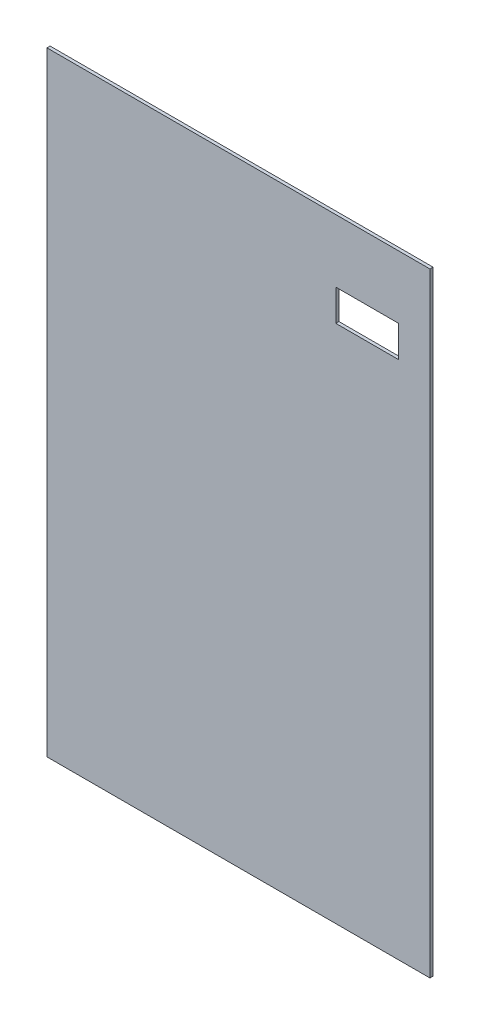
ISO-10303-21;
HEADER;
FILE_DESCRIPTION(('STEP AP214'),'2;1');
FILE_NAME('part.step','',(''),(''),'','','');
FILE_SCHEMA(('AUTOMOTIVE_DESIGN { 1 0 10303 214 1 1 1 1 }'));
ENDSEC;
DATA;
#1=APPLICATION_CONTEXT('core data for automotive mechanical design processes');
#2=APPLICATION_PROTOCOL_DEFINITION('international standard','automotive_design',2000,#1);
#3=PRODUCT_CONTEXT('',#1,'mechanical');
#4=PRODUCT('Part','Part','',(#3));
#5=PRODUCT_RELATED_PRODUCT_CATEGORY('part','',(#4));
#6=PRODUCT_DEFINITION_FORMATION('','',#4);
#7=PRODUCT_DEFINITION_CONTEXT('part definition',#1,'design');
#8=PRODUCT_DEFINITION('design','',#6,#7);
#9=PRODUCT_DEFINITION_SHAPE('','',#8);
#10=(LENGTH_UNIT() NAMED_UNIT(*) SI_UNIT(.MILLI.,.METRE.));
#11=(NAMED_UNIT(*) PLANE_ANGLE_UNIT() SI_UNIT($,.RADIAN.));
#12=(NAMED_UNIT(*) SI_UNIT($,.STERADIAN.) SOLID_ANGLE_UNIT());
#13=UNCERTAINTY_MEASURE_WITH_UNIT(LENGTH_MEASURE(1.E-05),#10,'distance_accuracy_value','');
#14=(GEOMETRIC_REPRESENTATION_CONTEXT(3) GLOBAL_UNCERTAINTY_ASSIGNED_CONTEXT((#13)) GLOBAL_UNIT_ASSIGNED_CONTEXT((#10,
#11,#12)) REPRESENTATION_CONTEXT('',''));
#15=CARTESIAN_POINT('',(0.,0.,0.));
#16=DIRECTION('',(0.,0.,1.));
#17=DIRECTION('',(1.,0.,0.));
#18=AXIS2_PLACEMENT_3D('',#15,#16,#17);
#19=CARTESIAN_POINT('',(0.,0.,10.));
#20=DIRECTION('',(1.,0.,0.));
#21=DIRECTION('',(0.,0.,-1.));
#22=AXIS2_PLACEMENT_3D('',#19,#20,#21);
#23=PLANE('',#22);
#24=DIRECTION('',(0.,-1.,0.));
#25=VECTOR('',#24,1.);
#26=CARTESIAN_POINT('',(0.,0.,0.));
#27=LINE('',#26,#25);
#28=CARTESIAN_POINT('',(0.,1955.8,0.));
#29=VERTEX_POINT('',#28);
#30=CARTESIAN_POINT('',(0.,0.,0.));
#31=VERTEX_POINT('',#30);
#32=EDGE_CURVE('E129',#29,#31,#27,.T.);
#33=ORIENTED_EDGE('',*,*,#32,.T.);
#34=DIRECTION('',(0.,0.,-1.));
#35=VECTOR('',#34,1.);
#36=CARTESIAN_POINT('',(0.,0.,10.));
#37=LINE('',#36,#35);
#38=CARTESIAN_POINT('',(0.,0.,10.));
#39=VERTEX_POINT('',#38);
#40=EDGE_CURVE('E11',#39,#31,#37,.T.);
#41=ORIENTED_EDGE('',*,*,#40,.F.);
#42=DIRECTION('',(0.,-1.,0.));
#43=VECTOR('',#42,1.);
#44=CARTESIAN_POINT('',(0.,0.,10.));
#45=LINE('',#44,#43);
#46=CARTESIAN_POINT('',(0.,1955.8,10.));
#47=VERTEX_POINT('',#46);
#48=EDGE_CURVE('E133',#47,#39,#45,.T.);
#49=ORIENTED_EDGE('',*,*,#48,.F.);
#50=DIRECTION('',(0.,0.,-1.));
#51=VECTOR('',#50,1.);
#52=CARTESIAN_POINT('',(0.,1955.8,10.));
#53=LINE('',#52,#51);
#54=EDGE_CURVE('E143',#47,#29,#53,.T.);
#55=ORIENTED_EDGE('',*,*,#54,.T.);
#56=EDGE_LOOP('',(#33,#41,#49,#55));
#57=FACE_BOUND('',#56,.T.);
#58=ADVANCED_FACE('F32',(#57),#23,.F.);
#59=CARTESIAN_POINT('',(0.,0.,10.));
#60=DIRECTION('',(0.,1.,0.));
#61=DIRECTION('',(0.,0.,1.));
#62=AXIS2_PLACEMENT_3D('',#59,#60,#61);
#63=PLANE('',#62);
#64=DIRECTION('',(1.,0.,0.));
#65=VECTOR('',#64,1.);
#66=CARTESIAN_POINT('',(0.,0.,0.));
#67=LINE('',#66,#65);
#68=CARTESIAN_POINT('',(1220.,0.,0.));
#69=VERTEX_POINT('',#68);
#70=EDGE_CURVE('E146',#31,#69,#67,.T.);
#71=ORIENTED_EDGE('',*,*,#70,.T.);
#72=DIRECTION('',(0.,0.,-1.));
#73=VECTOR('',#72,1.);
#74=CARTESIAN_POINT('',(1220.,0.,10.));
#75=LINE('',#74,#73);
#76=CARTESIAN_POINT('',(1220.,0.,10.));
#77=VERTEX_POINT('',#76);
#78=EDGE_CURVE('E39',#77,#69,#75,.T.);
#79=ORIENTED_EDGE('',*,*,#78,.F.);
#80=DIRECTION('',(1.,0.,0.));
#81=VECTOR('',#80,1.);
#82=CARTESIAN_POINT('',(0.,0.,10.));
#83=LINE('',#82,#81);
#84=EDGE_CURVE('E136',#39,#77,#83,.T.);
#85=ORIENTED_EDGE('',*,*,#84,.F.);
#86=ORIENTED_EDGE('',*,*,#40,.T.);
#87=EDGE_LOOP('',(#71,#79,#85,#86));
#88=FACE_BOUND('',#87,.T.);
#89=ADVANCED_FACE('F174',(#88),#63,.F.);
#90=CARTESIAN_POINT('',(1220.,0.,10.));
#91=DIRECTION('',(-1.,0.,0.));
#92=DIRECTION('',(0.,-1.,0.));
#93=AXIS2_PLACEMENT_3D('',#90,#91,#92);
#94=PLANE('',#93);
#95=DIRECTION('',(0.,1.,0.));
#96=VECTOR('',#95,1.);
#97=CARTESIAN_POINT('',(1220.,0.,0.));
#98=LINE('',#97,#96);
#99=CARTESIAN_POINT('',(1220.,1955.8,0.));
#100=VERTEX_POINT('',#99);
#101=EDGE_CURVE('E148',#69,#100,#98,.T.);
#102=ORIENTED_EDGE('',*,*,#101,.T.);
#103=DIRECTION('',(0.,0.,-1.));
#104=VECTOR('',#103,1.);
#105=CARTESIAN_POINT('',(1220.,1955.8,10.));
#106=LINE('',#105,#104);
#107=CARTESIAN_POINT('',(1220.,1955.8,10.));
#108=VERTEX_POINT('',#107);
#109=EDGE_CURVE('E153',#108,#100,#106,.T.);
#110=ORIENTED_EDGE('',*,*,#109,.F.);
#111=DIRECTION('',(0.,1.,0.));
#112=VECTOR('',#111,1.);
#113=CARTESIAN_POINT('',(1220.,0.,10.));
#114=LINE('',#113,#112);
#115=EDGE_CURVE('E139',#77,#108,#114,.T.);
#116=ORIENTED_EDGE('',*,*,#115,.F.);
#117=ORIENTED_EDGE('',*,*,#78,.T.);
#118=EDGE_LOOP('',(#102,#110,#116,#117));
#119=FACE_BOUND('',#118,.T.);
#120=ADVANCED_FACE('F160',(#119),#94,.F.);
#121=CARTESIAN_POINT('',(0.,1955.8,10.));
#122=DIRECTION('',(0.,-1.,0.));
#123=DIRECTION('',(0.,0.,-1.));
#124=AXIS2_PLACEMENT_3D('',#121,#122,#123);
#125=PLANE('',#124);
#126=DIRECTION('',(-1.,0.,0.));
#127=VECTOR('',#126,1.);
#128=CARTESIAN_POINT('',(0.,1955.8,0.));
#129=LINE('',#128,#127);
#130=EDGE_CURVE('E137',#100,#29,#129,.T.);
#131=ORIENTED_EDGE('',*,*,#130,.T.);
#132=ORIENTED_EDGE('',*,*,#54,.F.);
#133=DIRECTION('',(-1.,0.,0.));
#134=VECTOR('',#133,1.);
#135=CARTESIAN_POINT('',(0.,1955.8,10.));
#136=LINE('',#135,#134);
#137=EDGE_CURVE('E141',#108,#47,#136,.T.);
#138=ORIENTED_EDGE('',*,*,#137,.F.);
#139=ORIENTED_EDGE('',*,*,#109,.T.);
#140=EDGE_LOOP('',(#131,#132,#138,#139));
#141=FACE_BOUND('',#140,.T.);
#142=ADVANCED_FACE('F167',(#141),#125,.F.);
#143=CARTESIAN_POINT('',(0.,0.,10.));
#144=DIRECTION('',(0.,0.,-1.));
#145=DIRECTION('',(-1.,0.,0.));
#146=AXIS2_PLACEMENT_3D('',#143,#144,#145);
#147=PLANE('',#146);
#148=DIRECTION('',(1.,0.,0.));
#149=VECTOR('',#148,1.);
#150=CARTESIAN_POINT('',(920.,1655.8,10.));
#151=LINE('',#150,#149);
#152=CARTESIAN_POINT('',(920.,1655.8,10.));
#153=VERTEX_POINT('',#152);
#154=CARTESIAN_POINT('',(1120.,1655.8,10.));
#155=VERTEX_POINT('',#154);
#156=EDGE_CURVE('E123',#153,#155,#151,.T.);
#157=ORIENTED_EDGE('',*,*,#156,.F.);
#158=DIRECTION('',(0.,-1.,0.));
#159=VECTOR('',#158,1.);
#160=CARTESIAN_POINT('',(920.,1755.8,10.));
#161=LINE('',#160,#159);
#162=CARTESIAN_POINT('',(920.,1755.8,10.));
#163=VERTEX_POINT('',#162);
#164=EDGE_CURVE('E46',#163,#153,#161,.T.);
#165=ORIENTED_EDGE('',*,*,#164,.F.);
#166=DIRECTION('',(-1.,0.,0.));
#167=VECTOR('',#166,1.);
#168=CARTESIAN_POINT('',(920.,1755.8,10.));
#169=LINE('',#168,#167);
#170=CARTESIAN_POINT('',(1120.,1755.8,10.));
#171=VERTEX_POINT('',#170);
#172=EDGE_CURVE('E114',#171,#163,#169,.T.);
#173=ORIENTED_EDGE('',*,*,#172,.F.);
#174=DIRECTION('',(0.,1.,0.));
#175=VECTOR('',#174,1.);
#176=CARTESIAN_POINT('',(1120.,1755.8,10.));
#177=LINE('',#176,#175);
#178=EDGE_CURVE('E117',#155,#171,#177,.T.);
#179=ORIENTED_EDGE('',*,*,#178,.F.);
#180=EDGE_LOOP('',(#157,#165,#173,#179));
#181=FACE_BOUND('',#180,.T.);
#182=ORIENTED_EDGE('',*,*,#48,.T.);
#183=ORIENTED_EDGE('',*,*,#84,.T.);
#184=ORIENTED_EDGE('',*,*,#115,.T.);
#185=ORIENTED_EDGE('',*,*,#137,.T.);
#186=EDGE_LOOP('',(#182,#183,#184,#185));
#187=FACE_BOUND('',#186,.T.);
#188=ADVANCED_FACE('F173',(#181,#187),#147,.F.);
#189=CARTESIAN_POINT('',(0.,0.,0.));
#190=DIRECTION('',(0.,0.,-1.));
#191=DIRECTION('',(-1.,0.,0.));
#192=AXIS2_PLACEMENT_3D('',#189,#190,#191);
#193=PLANE('',#192);
#194=DIRECTION('',(0.,-1.,0.));
#195=VECTOR('',#194,1.);
#196=CARTESIAN_POINT('',(920.,1755.8,0.));
#197=LINE('',#196,#195);
#198=CARTESIAN_POINT('',(920.,1755.8,0.));
#199=VERTEX_POINT('',#198);
#200=CARTESIAN_POINT('',(920.,1655.8,0.));
#201=VERTEX_POINT('',#200);
#202=EDGE_CURVE('E98',#199,#201,#197,.T.);
#203=ORIENTED_EDGE('',*,*,#202,.T.);
#204=DIRECTION('',(1.,0.,0.));
#205=VECTOR('',#204,1.);
#206=CARTESIAN_POINT('',(920.,1655.8,0.));
#207=LINE('',#206,#205);
#208=CARTESIAN_POINT('',(1120.,1655.8,0.));
#209=VERTEX_POINT('',#208);
#210=EDGE_CURVE('E107',#201,#209,#207,.T.);
#211=ORIENTED_EDGE('',*,*,#210,.T.);
#212=DIRECTION('',(0.,1.,0.));
#213=VECTOR('',#212,1.);
#214=CARTESIAN_POINT('',(1120.,1755.8,0.));
#215=LINE('',#214,#213);
#216=CARTESIAN_POINT('',(1120.,1755.8,0.));
#217=VERTEX_POINT('',#216);
#218=EDGE_CURVE('E54',#209,#217,#215,.T.);
#219=ORIENTED_EDGE('',*,*,#218,.T.);
#220=DIRECTION('',(-1.,0.,0.));
#221=VECTOR('',#220,1.);
#222=CARTESIAN_POINT('',(920.,1755.8,0.));
#223=LINE('',#222,#221);
#224=EDGE_CURVE('E104',#217,#199,#223,.T.);
#225=ORIENTED_EDGE('',*,*,#224,.T.);
#226=EDGE_LOOP('',(#203,#211,#219,#225));
#227=FACE_BOUND('',#226,.T.);
#228=ORIENTED_EDGE('',*,*,#32,.F.);
#229=ORIENTED_EDGE('',*,*,#130,.F.);
#230=ORIENTED_EDGE('',*,*,#101,.F.);
#231=ORIENTED_EDGE('',*,*,#70,.F.);
#232=EDGE_LOOP('',(#228,#229,#230,#231));
#233=FACE_BOUND('',#232,.T.);
#234=ADVANCED_FACE('F111',(#227,#233),#193,.T.);
#235=CARTESIAN_POINT('',(920.,1755.8,0.));
#236=DIRECTION('',(-1.,0.,0.));
#237=DIRECTION('',(0.,0.,1.));
#238=AXIS2_PLACEMENT_3D('',#235,#236,#237);
#239=PLANE('',#238);
#240=ORIENTED_EDGE('',*,*,#164,.T.);
#241=DIRECTION('',(0.,0.,1.));
#242=VECTOR('',#241,1.);
#243=CARTESIAN_POINT('',(920.,1655.8,0.));
#244=LINE('',#243,#242);
#245=EDGE_CURVE('E94',#201,#153,#244,.T.);
#246=ORIENTED_EDGE('',*,*,#245,.F.);
#247=ORIENTED_EDGE('',*,*,#202,.F.);
#248=DIRECTION('',(0.,0.,1.));
#249=VECTOR('',#248,1.);
#250=CARTESIAN_POINT('',(920.,1755.8,0.));
#251=LINE('',#250,#249);
#252=EDGE_CURVE('E127',#199,#163,#251,.T.);
#253=ORIENTED_EDGE('',*,*,#252,.T.);
#254=EDGE_LOOP('',(#240,#246,#247,#253));
#255=FACE_BOUND('',#254,.T.);
#256=ADVANCED_FACE('F96',(#255),#239,.F.);
#257=CARTESIAN_POINT('',(920.,1755.8,0.));
#258=DIRECTION('',(0.,1.,0.));
#259=DIRECTION('',(0.,0.,1.));
#260=AXIS2_PLACEMENT_3D('',#257,#258,#259);
#261=PLANE('',#260);
#262=ORIENTED_EDGE('',*,*,#172,.T.);
#263=ORIENTED_EDGE('',*,*,#252,.F.);
#264=ORIENTED_EDGE('',*,*,#224,.F.);
#265=DIRECTION('',(0.,0.,1.));
#266=VECTOR('',#265,1.);
#267=CARTESIAN_POINT('',(1120.,1755.8,0.));
#268=LINE('',#267,#266);
#269=EDGE_CURVE('E130',#217,#171,#268,.T.);
#270=ORIENTED_EDGE('',*,*,#269,.T.);
#271=EDGE_LOOP('',(#262,#263,#264,#270));
#272=FACE_BOUND('',#271,.T.);
#273=ADVANCED_FACE('F191',(#272),#261,.F.);
#274=CARTESIAN_POINT('',(1120.,1755.8,0.));
#275=DIRECTION('',(1.,0.,0.));
#276=DIRECTION('',(0.,0.,-1.));
#277=AXIS2_PLACEMENT_3D('',#274,#275,#276);
#278=PLANE('',#277);
#279=ORIENTED_EDGE('',*,*,#178,.T.);
#280=ORIENTED_EDGE('',*,*,#269,.F.);
#281=ORIENTED_EDGE('',*,*,#218,.F.);
#282=DIRECTION('',(0.,0.,1.));
#283=VECTOR('',#282,1.);
#284=CARTESIAN_POINT('',(1120.,1655.8,0.));
#285=LINE('',#284,#283);
#286=EDGE_CURVE('E103',#209,#155,#285,.T.);
#287=ORIENTED_EDGE('',*,*,#286,.T.);
#288=EDGE_LOOP('',(#279,#280,#281,#287));
#289=FACE_BOUND('',#288,.T.);
#290=ADVANCED_FACE('F194',(#289),#278,.F.);
#291=CARTESIAN_POINT('',(920.,1655.8,0.));
#292=DIRECTION('',(0.,-1.,0.));
#293=DIRECTION('',(1.,0.,0.));
#294=AXIS2_PLACEMENT_3D('',#291,#292,#293);
#295=PLANE('',#294);
#296=ORIENTED_EDGE('',*,*,#156,.T.);
#297=ORIENTED_EDGE('',*,*,#286,.F.);
#298=ORIENTED_EDGE('',*,*,#210,.F.);
#299=ORIENTED_EDGE('',*,*,#245,.T.);
#300=EDGE_LOOP('',(#296,#297,#298,#299));
#301=FACE_BOUND('',#300,.T.);
#302=ADVANCED_FACE('F108',(#301),#295,.F.);
#303=CLOSED_SHELL('',(#58,#89,#120,#142,#188,#234,#256,#273,#290,#302));
#304=MANIFOLD_SOLID_BREP('B2',#303);
#305=ADVANCED_BREP_SHAPE_REPRESENTATION('',(#18,#304),#14);
#306=SHAPE_DEFINITION_REPRESENTATION(#9,#305);
ENDSEC;
END-ISO-10303-21;
